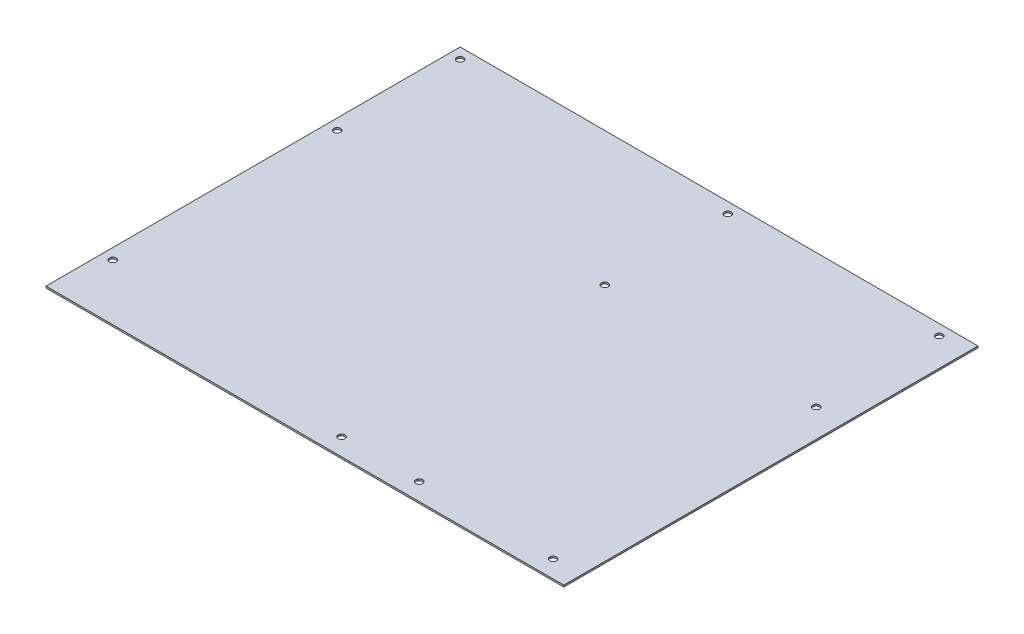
ISO-10303-21;
HEADER;
FILE_DESCRIPTION(('STEP AP214'),'2;1');
FILE_NAME('part.step','',(''),(''),'','','');
FILE_SCHEMA(('AUTOMOTIVE_DESIGN { 1 0 10303 214 1 1 1 1 }'));
ENDSEC;
DATA;
#1=APPLICATION_CONTEXT('core data for automotive mechanical design processes');
#2=APPLICATION_PROTOCOL_DEFINITION('international standard','automotive_design',2000,#1);
#3=PRODUCT_CONTEXT('',#1,'mechanical');
#4=PRODUCT('Part','Part','',(#3));
#5=PRODUCT_RELATED_PRODUCT_CATEGORY('part','',(#4));
#6=PRODUCT_DEFINITION_FORMATION('','',#4);
#7=PRODUCT_DEFINITION_CONTEXT('part definition',#1,'design');
#8=PRODUCT_DEFINITION('design','',#6,#7);
#9=PRODUCT_DEFINITION_SHAPE('','',#8);
#10=(LENGTH_UNIT() NAMED_UNIT(*) SI_UNIT(.MILLI.,.METRE.));
#11=(NAMED_UNIT(*) PLANE_ANGLE_UNIT() SI_UNIT($,.RADIAN.));
#12=(NAMED_UNIT(*) SI_UNIT($,.STERADIAN.) SOLID_ANGLE_UNIT());
#13=UNCERTAINTY_MEASURE_WITH_UNIT(LENGTH_MEASURE(1.E-05),#10,'distance_accuracy_value','');
#14=(GEOMETRIC_REPRESENTATION_CONTEXT(3) GLOBAL_UNCERTAINTY_ASSIGNED_CONTEXT((#13)) GLOBAL_UNIT_ASSIGNED_CONTEXT((#10,
#11,#12)) REPRESENTATION_CONTEXT('',''));
#15=CARTESIAN_POINT('',(0.,0.,0.));
#16=DIRECTION('',(0.,0.,1.));
#17=DIRECTION('',(1.,0.,0.));
#18=AXIS2_PLACEMENT_3D('',#15,#16,#17);
#19=CARTESIAN_POINT('',(0.,1.,0.));
#20=DIRECTION('',(-1.,0.,0.));
#21=DIRECTION('',(0.,0.,1.));
#22=AXIS2_PLACEMENT_3D('',#19,#20,#21);
#23=PLANE('',#22);
#24=DIRECTION('',(0.,0.,-1.));
#25=VECTOR('',#24,1.);
#26=CARTESIAN_POINT('',(0.,0.,0.));
#27=LINE('',#26,#25);
#28=CARTESIAN_POINT('',(0.,0.,0.));
#29=VERTEX_POINT('',#28);
#30=CARTESIAN_POINT('',(0.,0.,-243.8));
#31=VERTEX_POINT('',#30);
#32=EDGE_CURVE('E95',#29,#31,#27,.T.);
#33=ORIENTED_EDGE('',*,*,#32,.T.);
#34=DIRECTION('',(0.,-1.,0.));
#35=VECTOR('',#34,1.);
#36=CARTESIAN_POINT('',(0.,1.,-243.8));
#37=LINE('',#36,#35);
#38=CARTESIAN_POINT('',(0.,1.,-243.8));
#39=VERTEX_POINT('',#38);
#40=EDGE_CURVE('E11',#39,#31,#37,.T.);
#41=ORIENTED_EDGE('',*,*,#40,.F.);
#42=DIRECTION('',(0.,0.,-1.));
#43=VECTOR('',#42,1.);
#44=CARTESIAN_POINT('',(0.,1.,0.));
#45=LINE('',#44,#43);
#46=CARTESIAN_POINT('',(0.,1.,0.));
#47=VERTEX_POINT('',#46);
#48=EDGE_CURVE('E83',#47,#39,#45,.T.);
#49=ORIENTED_EDGE('',*,*,#48,.F.);
#50=DIRECTION('',(0.,-1.,0.));
#51=VECTOR('',#50,1.);
#52=CARTESIAN_POINT('',(0.,1.,0.));
#53=LINE('',#52,#51);
#54=EDGE_CURVE('E91',#47,#29,#53,.T.);
#55=ORIENTED_EDGE('',*,*,#54,.T.);
#56=EDGE_LOOP('',(#33,#41,#49,#55));
#57=FACE_BOUND('',#56,.T.);
#58=ADVANCED_FACE('F32',(#57),#23,.F.);
#59=CARTESIAN_POINT('',(0.,1.,-243.8));
#60=DIRECTION('',(0.,0.,1.));
#61=DIRECTION('',(1.,0.,0.));
#62=AXIS2_PLACEMENT_3D('',#59,#60,#61);
#63=PLANE('',#62);
#64=DIRECTION('',(-1.,0.,0.));
#65=VECTOR('',#64,1.);
#66=CARTESIAN_POINT('',(0.,0.,-243.8));
#67=LINE('',#66,#65);
#68=CARTESIAN_POINT('',(-304.8,0.,-243.8));
#69=VERTEX_POINT('',#68);
#70=EDGE_CURVE('E87',#31,#69,#67,.T.);
#71=ORIENTED_EDGE('',*,*,#70,.T.);
#72=DIRECTION('',(0.,-1.,0.));
#73=VECTOR('',#72,1.);
#74=CARTESIAN_POINT('',(-304.8,1.,-243.8));
#75=LINE('',#74,#73);
#76=CARTESIAN_POINT('',(-304.8,1.,-243.8));
#77=VERTEX_POINT('',#76);
#78=EDGE_CURVE('E40',#77,#69,#75,.T.);
#79=ORIENTED_EDGE('',*,*,#78,.F.);
#80=DIRECTION('',(-1.,0.,0.));
#81=VECTOR('',#80,1.);
#82=CARTESIAN_POINT('',(0.,1.,-243.8));
#83=LINE('',#82,#81);
#84=EDGE_CURVE('E78',#39,#77,#83,.T.);
#85=ORIENTED_EDGE('',*,*,#84,.F.);
#86=ORIENTED_EDGE('',*,*,#40,.T.);
#87=EDGE_LOOP('',(#71,#79,#85,#86));
#88=FACE_BOUND('',#87,.T.);
#89=ADVANCED_FACE('F86',(#88),#63,.F.);
#90=CARTESIAN_POINT('',(-304.8,1.,0.));
#91=DIRECTION('',(1.,0.,0.));
#92=DIRECTION('',(0.,0.,-1.));
#93=AXIS2_PLACEMENT_3D('',#90,#91,#92);
#94=PLANE('',#93);
#95=DIRECTION('',(0.,0.,1.));
#96=VECTOR('',#95,1.);
#97=CARTESIAN_POINT('',(-304.8,0.,0.));
#98=LINE('',#97,#96);
#99=CARTESIAN_POINT('',(-304.8,0.,0.));
#100=VERTEX_POINT('',#99);
#101=EDGE_CURVE('E65',#69,#100,#98,.T.);
#102=ORIENTED_EDGE('',*,*,#101,.T.);
#103=DIRECTION('',(0.,-1.,0.));
#104=VECTOR('',#103,1.);
#105=CARTESIAN_POINT('',(-304.8,1.,0.));
#106=LINE('',#105,#104);
#107=CARTESIAN_POINT('',(-304.8,1.,0.));
#108=VERTEX_POINT('',#107);
#109=EDGE_CURVE('E88',#108,#100,#106,.T.);
#110=ORIENTED_EDGE('',*,*,#109,.F.);
#111=DIRECTION('',(0.,0.,1.));
#112=VECTOR('',#111,1.);
#113=CARTESIAN_POINT('',(-304.8,1.,0.));
#114=LINE('',#113,#112);
#115=EDGE_CURVE('E81',#77,#108,#114,.T.);
#116=ORIENTED_EDGE('',*,*,#115,.F.);
#117=ORIENTED_EDGE('',*,*,#78,.T.);
#118=EDGE_LOOP('',(#102,#110,#116,#117));
#119=FACE_BOUND('',#118,.T.);
#120=ADVANCED_FACE('F89',(#119),#94,.F.);
#121=CARTESIAN_POINT('',(0.,1.,0.));
#122=DIRECTION('',(0.,0.,-1.));
#123=DIRECTION('',(-1.,0.,0.));
#124=AXIS2_PLACEMENT_3D('',#121,#122,#123);
#125=PLANE('',#124);
#126=DIRECTION('',(1.,0.,0.));
#127=VECTOR('',#126,1.);
#128=CARTESIAN_POINT('',(0.,0.,0.));
#129=LINE('',#128,#127);
#130=EDGE_CURVE('E71',#100,#29,#129,.T.);
#131=ORIENTED_EDGE('',*,*,#130,.T.);
#132=ORIENTED_EDGE('',*,*,#54,.F.);
#133=DIRECTION('',(1.,0.,0.));
#134=VECTOR('',#133,1.);
#135=CARTESIAN_POINT('',(0.,1.,0.));
#136=LINE('',#135,#134);
#137=EDGE_CURVE('E48',#108,#47,#136,.T.);
#138=ORIENTED_EDGE('',*,*,#137,.F.);
#139=ORIENTED_EDGE('',*,*,#109,.T.);
#140=EDGE_LOOP('',(#131,#132,#138,#139));
#141=FACE_BOUND('',#140,.T.);
#142=ADVANCED_FACE('F103',(#141),#125,.F.);
#143=CARTESIAN_POINT('',(0.,1.,0.));
#144=DIRECTION('',(0.,1.,0.));
#145=DIRECTION('',(0.,0.,1.));
#146=AXIS2_PLACEMENT_3D('',#143,#144,#145);
#147=PLANE('',#146);
#148=CARTESIAN_POINT('',(-298.5,1.,-32.9999999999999));
#149=DIRECTION('',(0.,1.,0.));
#150=DIRECTION('',(0.,0.,1.));
#151=AXIS2_PLACEMENT_3D('',#148,#149,#150);
#152=CIRCLE('',#151,2.);
#153=CARTESIAN_POINT('',(-298.5,1.,-31.));
#154=VERTEX_POINT('',#153);
#155=EDGE_CURVE('E163',#154,#154,#152,.T.);
#156=ORIENTED_EDGE('',*,*,#155,.F.);
#157=EDGE_LOOP('',(#156));
#158=FACE_BOUND('',#157,.T.);
#159=CARTESIAN_POINT('',(-95.3,1.,-10.2));
#160=DIRECTION('',(0.,1.,0.));
#161=DIRECTION('',(0.,0.,1.));
#162=AXIS2_PLACEMENT_3D('',#159,#160,#161);
#163=CIRCLE('',#162,2.);
#164=CARTESIAN_POINT('',(-95.3,1.,-8.19999999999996));
#165=VERTEX_POINT('',#164);
#166=EDGE_CURVE('E157',#165,#165,#163,.T.);
#167=ORIENTED_EDGE('',*,*,#166,.F.);
#168=EDGE_LOOP('',(#167));
#169=FACE_BOUND('',#168,.T.);
#170=CARTESIAN_POINT('',(-141.,1.,-10.2));
#171=DIRECTION('',(0.,1.,0.));
#172=DIRECTION('',(0.,0.,1.));
#173=AXIS2_PLACEMENT_3D('',#170,#171,#172);
#174=CIRCLE('',#173,2.);
#175=CARTESIAN_POINT('',(-141.,1.,-8.19999999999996));
#176=VERTEX_POINT('',#175);
#177=EDGE_CURVE('E151',#176,#176,#174,.T.);
#178=ORIENTED_EDGE('',*,*,#177,.F.);
#179=EDGE_LOOP('',(#178));
#180=FACE_BOUND('',#179,.T.);
#181=CARTESIAN_POINT('',(-141.,1.,-165.1));
#182=DIRECTION('',(0.,1.,0.));
#183=DIRECTION('',(0.,0.,1.));
#184=AXIS2_PLACEMENT_3D('',#181,#182,#183);
#185=CIRCLE('',#184,2.);
#186=CARTESIAN_POINT('',(-141.,1.,-163.1));
#187=VERTEX_POINT('',#186);
#188=EDGE_CURVE('E145',#187,#187,#185,.T.);
#189=ORIENTED_EDGE('',*,*,#188,.F.);
#190=EDGE_LOOP('',(#189));
#191=FACE_BOUND('',#190,.T.);
#192=CARTESIAN_POINT('',(-141.,1.,-237.5));
#193=DIRECTION('',(0.,1.,0.));
#194=DIRECTION('',(0.,0.,1.));
#195=AXIS2_PLACEMENT_3D('',#192,#193,#194);
#196=CIRCLE('',#195,2.);
#197=CARTESIAN_POINT('',(-141.,1.,-235.5));
#198=VERTEX_POINT('',#197);
#199=EDGE_CURVE('E139',#198,#198,#196,.T.);
#200=ORIENTED_EDGE('',*,*,#199,.F.);
#201=EDGE_LOOP('',(#200));
#202=FACE_BOUND('',#201,.T.);
#203=CARTESIAN_POINT('',(-298.5,1.,-237.5));
#204=DIRECTION('',(0.,1.,0.));
#205=DIRECTION('',(0.,0.,1.));
#206=AXIS2_PLACEMENT_3D('',#203,#204,#205);
#207=CIRCLE('',#206,2.);
#208=CARTESIAN_POINT('',(-298.5,1.,-235.5));
#209=VERTEX_POINT('',#208);
#210=EDGE_CURVE('E133',#209,#209,#207,.T.);
#211=ORIENTED_EDGE('',*,*,#210,.F.);
#212=EDGE_LOOP('',(#211));
#213=FACE_BOUND('',#212,.T.);
#214=CARTESIAN_POINT('',(-298.5,1.,-165.1));
#215=DIRECTION('',(0.,1.,0.));
#216=DIRECTION('',(0.,0.,1.));
#217=AXIS2_PLACEMENT_3D('',#214,#215,#216);
#218=CIRCLE('',#217,2.);
#219=CARTESIAN_POINT('',(-298.5,1.,-163.1));
#220=VERTEX_POINT('',#219);
#221=EDGE_CURVE('E127',#220,#220,#218,.T.);
#222=ORIENTED_EDGE('',*,*,#221,.F.);
#223=EDGE_LOOP('',(#222));
#224=FACE_BOUND('',#223,.T.);
#225=CARTESIAN_POINT('',(-16.5,1.,-10.2));
#226=DIRECTION('',(0.,1.,0.));
#227=DIRECTION('',(0.,0.,1.));
#228=AXIS2_PLACEMENT_3D('',#225,#226,#227);
#229=CIRCLE('',#228,2.);
#230=CARTESIAN_POINT('',(-16.5,1.,-8.19999999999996));
#231=VERTEX_POINT('',#230);
#232=EDGE_CURVE('E121',#231,#231,#229,.T.);
#233=ORIENTED_EDGE('',*,*,#232,.F.);
#234=EDGE_LOOP('',(#233));
#235=FACE_BOUND('',#234,.T.);
#236=CARTESIAN_POINT('',(-16.5,1.,-165.1));
#237=DIRECTION('',(0.,1.,0.));
#238=DIRECTION('',(0.,0.,1.));
#239=AXIS2_PLACEMENT_3D('',#236,#237,#238);
#240=CIRCLE('',#239,2.);
#241=CARTESIAN_POINT('',(-16.5,1.,-163.1));
#242=VERTEX_POINT('',#241);
#243=EDGE_CURVE('E115',#242,#242,#240,.T.);
#244=ORIENTED_EDGE('',*,*,#243,.F.);
#245=EDGE_LOOP('',(#244));
#246=FACE_BOUND('',#245,.T.);
#247=CARTESIAN_POINT('',(-16.5,1.,-237.5));
#248=DIRECTION('',(0.,1.,0.));
#249=DIRECTION('',(0.,0.,1.));
#250=AXIS2_PLACEMENT_3D('',#247,#248,#249);
#251=CIRCLE('',#250,2.);
#252=CARTESIAN_POINT('',(-16.5,1.,-235.5));
#253=VERTEX_POINT('',#252);
#254=EDGE_CURVE('E109',#253,#253,#251,.T.);
#255=ORIENTED_EDGE('',*,*,#254,.F.);
#256=EDGE_LOOP('',(#255));
#257=FACE_BOUND('',#256,.T.);
#258=ORIENTED_EDGE('',*,*,#48,.T.);
#259=ORIENTED_EDGE('',*,*,#84,.T.);
#260=ORIENTED_EDGE('',*,*,#115,.T.);
#261=ORIENTED_EDGE('',*,*,#137,.T.);
#262=EDGE_LOOP('',(#258,#259,#260,#261));
#263=FACE_BOUND('',#262,.T.);
#264=ADVANCED_FACE('F79',(#158,#169,#180,#191,#202,#213,#224,#235,#246,#257,#263),#147,.T.);
#265=CARTESIAN_POINT('',(0.,0.,0.));
#266=DIRECTION('',(0.,1.,0.));
#267=DIRECTION('',(0.,0.,1.));
#268=AXIS2_PLACEMENT_3D('',#265,#266,#267);
#269=PLANE('',#268);
#270=CARTESIAN_POINT('',(-298.5,0.,-32.9999999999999));
#271=DIRECTION('',(0.,1.,0.));
#272=DIRECTION('',(0.,0.,1.));
#273=AXIS2_PLACEMENT_3D('',#270,#271,#272);
#274=CIRCLE('',#273,2.);
#275=CARTESIAN_POINT('',(-298.5,0.,-31.));
#276=VERTEX_POINT('',#275);
#277=EDGE_CURVE('E160',#276,#276,#274,.T.);
#278=ORIENTED_EDGE('',*,*,#277,.T.);
#279=EDGE_LOOP('',(#278));
#280=FACE_BOUND('',#279,.T.);
#281=CARTESIAN_POINT('',(-95.3,0.,-10.2));
#282=DIRECTION('',(0.,1.,0.));
#283=DIRECTION('',(0.,0.,1.));
#284=AXIS2_PLACEMENT_3D('',#281,#282,#283);
#285=CIRCLE('',#284,2.);
#286=CARTESIAN_POINT('',(-95.3,0.,-8.19999999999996));
#287=VERTEX_POINT('',#286);
#288=EDGE_CURVE('E154',#287,#287,#285,.T.);
#289=ORIENTED_EDGE('',*,*,#288,.T.);
#290=EDGE_LOOP('',(#289));
#291=FACE_BOUND('',#290,.T.);
#292=CARTESIAN_POINT('',(-141.,0.,-10.2));
#293=DIRECTION('',(0.,1.,0.));
#294=DIRECTION('',(0.,0.,1.));
#295=AXIS2_PLACEMENT_3D('',#292,#293,#294);
#296=CIRCLE('',#295,2.);
#297=CARTESIAN_POINT('',(-141.,0.,-8.19999999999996));
#298=VERTEX_POINT('',#297);
#299=EDGE_CURVE('E148',#298,#298,#296,.T.);
#300=ORIENTED_EDGE('',*,*,#299,.T.);
#301=EDGE_LOOP('',(#300));
#302=FACE_BOUND('',#301,.T.);
#303=CARTESIAN_POINT('',(-141.,0.,-165.1));
#304=DIRECTION('',(0.,1.,0.));
#305=DIRECTION('',(0.,0.,1.));
#306=AXIS2_PLACEMENT_3D('',#303,#304,#305);
#307=CIRCLE('',#306,2.);
#308=CARTESIAN_POINT('',(-141.,0.,-163.1));
#309=VERTEX_POINT('',#308);
#310=EDGE_CURVE('E142',#309,#309,#307,.T.);
#311=ORIENTED_EDGE('',*,*,#310,.T.);
#312=EDGE_LOOP('',(#311));
#313=FACE_BOUND('',#312,.T.);
#314=CARTESIAN_POINT('',(-141.,0.,-237.5));
#315=DIRECTION('',(0.,1.,0.));
#316=DIRECTION('',(0.,0.,1.));
#317=AXIS2_PLACEMENT_3D('',#314,#315,#316);
#318=CIRCLE('',#317,2.);
#319=CARTESIAN_POINT('',(-141.,0.,-235.5));
#320=VERTEX_POINT('',#319);
#321=EDGE_CURVE('E136',#320,#320,#318,.T.);
#322=ORIENTED_EDGE('',*,*,#321,.T.);
#323=EDGE_LOOP('',(#322));
#324=FACE_BOUND('',#323,.T.);
#325=CARTESIAN_POINT('',(-298.5,0.,-237.5));
#326=DIRECTION('',(0.,1.,0.));
#327=DIRECTION('',(0.,0.,1.));
#328=AXIS2_PLACEMENT_3D('',#325,#326,#327);
#329=CIRCLE('',#328,2.);
#330=CARTESIAN_POINT('',(-298.5,0.,-235.5));
#331=VERTEX_POINT('',#330);
#332=EDGE_CURVE('E130',#331,#331,#329,.T.);
#333=ORIENTED_EDGE('',*,*,#332,.T.);
#334=EDGE_LOOP('',(#333));
#335=FACE_BOUND('',#334,.T.);
#336=CARTESIAN_POINT('',(-298.5,0.,-165.1));
#337=DIRECTION('',(0.,1.,0.));
#338=DIRECTION('',(0.,0.,1.));
#339=AXIS2_PLACEMENT_3D('',#336,#337,#338);
#340=CIRCLE('',#339,2.);
#341=CARTESIAN_POINT('',(-298.5,0.,-163.1));
#342=VERTEX_POINT('',#341);
#343=EDGE_CURVE('E124',#342,#342,#340,.T.);
#344=ORIENTED_EDGE('',*,*,#343,.T.);
#345=EDGE_LOOP('',(#344));
#346=FACE_BOUND('',#345,.T.);
#347=CARTESIAN_POINT('',(-16.5,0.,-10.2));
#348=DIRECTION('',(0.,1.,0.));
#349=DIRECTION('',(0.,0.,1.));
#350=AXIS2_PLACEMENT_3D('',#347,#348,#349);
#351=CIRCLE('',#350,2.);
#352=CARTESIAN_POINT('',(-16.5,0.,-8.19999999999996));
#353=VERTEX_POINT('',#352);
#354=EDGE_CURVE('E118',#353,#353,#351,.T.);
#355=ORIENTED_EDGE('',*,*,#354,.T.);
#356=EDGE_LOOP('',(#355));
#357=FACE_BOUND('',#356,.T.);
#358=CARTESIAN_POINT('',(-16.5,0.,-165.1));
#359=DIRECTION('',(0.,1.,0.));
#360=DIRECTION('',(0.,0.,1.));
#361=AXIS2_PLACEMENT_3D('',#358,#359,#360);
#362=CIRCLE('',#361,2.);
#363=CARTESIAN_POINT('',(-16.5,0.,-163.1));
#364=VERTEX_POINT('',#363);
#365=EDGE_CURVE('E112',#364,#364,#362,.T.);
#366=ORIENTED_EDGE('',*,*,#365,.T.);
#367=EDGE_LOOP('',(#366));
#368=FACE_BOUND('',#367,.T.);
#369=CARTESIAN_POINT('',(-16.5,0.,-237.5));
#370=DIRECTION('',(0.,1.,0.));
#371=DIRECTION('',(0.,0.,1.));
#372=AXIS2_PLACEMENT_3D('',#369,#370,#371);
#373=CIRCLE('',#372,2.);
#374=CARTESIAN_POINT('',(-16.5,0.,-235.5));
#375=VERTEX_POINT('',#374);
#376=EDGE_CURVE('E98',#375,#375,#373,.T.);
#377=ORIENTED_EDGE('',*,*,#376,.T.);
#378=EDGE_LOOP('',(#377));
#379=FACE_BOUND('',#378,.T.);
#380=ORIENTED_EDGE('',*,*,#32,.F.);
#381=ORIENTED_EDGE('',*,*,#130,.F.);
#382=ORIENTED_EDGE('',*,*,#101,.F.);
#383=ORIENTED_EDGE('',*,*,#70,.F.);
#384=EDGE_LOOP('',(#380,#381,#382,#383));
#385=FACE_BOUND('',#384,.T.);
#386=ADVANCED_FACE('F106',(#280,#291,#302,#313,#324,#335,#346,#357,#368,#379,#385),#269,.F.);
#387=CARTESIAN_POINT('',(-16.5,0.,-237.5));
#388=DIRECTION('',(0.,1.,0.));
#389=DIRECTION('',(0.,0.,1.));
#390=AXIS2_PLACEMENT_3D('',#387,#388,#389);
#391=CYLINDRICAL_SURFACE('',#390,2.);
#392=ORIENTED_EDGE('',*,*,#376,.F.);
#393=EDGE_LOOP('',(#392));
#394=FACE_BOUND('',#393,.T.);
#395=ORIENTED_EDGE('',*,*,#254,.T.);
#396=EDGE_LOOP('',(#395));
#397=FACE_BOUND('',#396,.T.);
#398=ADVANCED_FACE('F199',(#394,#397),#391,.F.);
#399=CARTESIAN_POINT('',(-16.5,0.,-165.1));
#400=DIRECTION('',(0.,1.,0.));
#401=DIRECTION('',(0.,0.,1.));
#402=AXIS2_PLACEMENT_3D('',#399,#400,#401);
#403=CYLINDRICAL_SURFACE('',#402,2.);
#404=ORIENTED_EDGE('',*,*,#365,.F.);
#405=EDGE_LOOP('',(#404));
#406=FACE_BOUND('',#405,.T.);
#407=ORIENTED_EDGE('',*,*,#243,.T.);
#408=EDGE_LOOP('',(#407));
#409=FACE_BOUND('',#408,.T.);
#410=ADVANCED_FACE('F201',(#406,#409),#403,.F.);
#411=CARTESIAN_POINT('',(-16.5,0.,-10.2));
#412=DIRECTION('',(0.,1.,0.));
#413=DIRECTION('',(0.,0.,1.));
#414=AXIS2_PLACEMENT_3D('',#411,#412,#413);
#415=CYLINDRICAL_SURFACE('',#414,2.);
#416=ORIENTED_EDGE('',*,*,#354,.F.);
#417=EDGE_LOOP('',(#416));
#418=FACE_BOUND('',#417,.T.);
#419=ORIENTED_EDGE('',*,*,#232,.T.);
#420=EDGE_LOOP('',(#419));
#421=FACE_BOUND('',#420,.T.);
#422=ADVANCED_FACE('F208',(#418,#421),#415,.F.);
#423=CARTESIAN_POINT('',(-298.5,0.,-165.1));
#424=DIRECTION('',(0.,1.,0.));
#425=DIRECTION('',(0.,0.,1.));
#426=AXIS2_PLACEMENT_3D('',#423,#424,#425);
#427=CYLINDRICAL_SURFACE('',#426,2.);
#428=ORIENTED_EDGE('',*,*,#343,.F.);
#429=EDGE_LOOP('',(#428));
#430=FACE_BOUND('',#429,.T.);
#431=ORIENTED_EDGE('',*,*,#221,.T.);
#432=EDGE_LOOP('',(#431));
#433=FACE_BOUND('',#432,.T.);
#434=ADVANCED_FACE('F254',(#430,#433),#427,.F.);
#435=CARTESIAN_POINT('',(-298.5,0.,-237.5));
#436=DIRECTION('',(0.,1.,0.));
#437=DIRECTION('',(0.,0.,1.));
#438=AXIS2_PLACEMENT_3D('',#435,#436,#437);
#439=CYLINDRICAL_SURFACE('',#438,2.);
#440=ORIENTED_EDGE('',*,*,#332,.F.);
#441=EDGE_LOOP('',(#440));
#442=FACE_BOUND('',#441,.T.);
#443=ORIENTED_EDGE('',*,*,#210,.T.);
#444=EDGE_LOOP('',(#443));
#445=FACE_BOUND('',#444,.T.);
#446=ADVANCED_FACE('F264',(#442,#445),#439,.F.);
#447=CARTESIAN_POINT('',(-141.,0.,-237.5));
#448=DIRECTION('',(0.,1.,0.));
#449=DIRECTION('',(0.,0.,1.));
#450=AXIS2_PLACEMENT_3D('',#447,#448,#449);
#451=CYLINDRICAL_SURFACE('',#450,2.);
#452=ORIENTED_EDGE('',*,*,#321,.F.);
#453=EDGE_LOOP('',(#452));
#454=FACE_BOUND('',#453,.T.);
#455=ORIENTED_EDGE('',*,*,#199,.T.);
#456=EDGE_LOOP('',(#455));
#457=FACE_BOUND('',#456,.T.);
#458=ADVANCED_FACE('F274',(#454,#457),#451,.F.);
#459=CARTESIAN_POINT('',(-141.,0.,-165.1));
#460=DIRECTION('',(0.,1.,0.));
#461=DIRECTION('',(0.,0.,1.));
#462=AXIS2_PLACEMENT_3D('',#459,#460,#461);
#463=CYLINDRICAL_SURFACE('',#462,2.);
#464=ORIENTED_EDGE('',*,*,#310,.F.);
#465=EDGE_LOOP('',(#464));
#466=FACE_BOUND('',#465,.T.);
#467=ORIENTED_EDGE('',*,*,#188,.T.);
#468=EDGE_LOOP('',(#467));
#469=FACE_BOUND('',#468,.T.);
#470=ADVANCED_FACE('F284',(#466,#469),#463,.F.);
#471=CARTESIAN_POINT('',(-141.,0.,-10.2));
#472=DIRECTION('',(0.,1.,0.));
#473=DIRECTION('',(0.,0.,1.));
#474=AXIS2_PLACEMENT_3D('',#471,#472,#473);
#475=CYLINDRICAL_SURFACE('',#474,2.);
#476=ORIENTED_EDGE('',*,*,#299,.F.);
#477=EDGE_LOOP('',(#476));
#478=FACE_BOUND('',#477,.T.);
#479=ORIENTED_EDGE('',*,*,#177,.T.);
#480=EDGE_LOOP('',(#479));
#481=FACE_BOUND('',#480,.T.);
#482=ADVANCED_FACE('F294',(#478,#481),#475,.F.);
#483=CARTESIAN_POINT('',(-95.3,0.,-10.2));
#484=DIRECTION('',(0.,1.,0.));
#485=DIRECTION('',(0.,0.,1.));
#486=AXIS2_PLACEMENT_3D('',#483,#484,#485);
#487=CYLINDRICAL_SURFACE('',#486,2.);
#488=ORIENTED_EDGE('',*,*,#288,.F.);
#489=EDGE_LOOP('',(#488));
#490=FACE_BOUND('',#489,.T.);
#491=ORIENTED_EDGE('',*,*,#166,.T.);
#492=EDGE_LOOP('',(#491));
#493=FACE_BOUND('',#492,.T.);
#494=ADVANCED_FACE('F174',(#490,#493),#487,.F.);
#495=CARTESIAN_POINT('',(-298.5,0.,-32.9999999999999));
#496=DIRECTION('',(0.,1.,0.));
#497=DIRECTION('',(0.,0.,1.));
#498=AXIS2_PLACEMENT_3D('',#495,#496,#497);
#499=CYLINDRICAL_SURFACE('',#498,2.);
#500=ORIENTED_EDGE('',*,*,#277,.F.);
#501=EDGE_LOOP('',(#500));
#502=FACE_BOUND('',#501,.T.);
#503=ORIENTED_EDGE('',*,*,#155,.T.);
#504=EDGE_LOOP('',(#503));
#505=FACE_BOUND('',#504,.T.);
#506=ADVANCED_FACE('F171',(#502,#505),#499,.F.);
#507=CLOSED_SHELL('',(#58,#89,#120,#142,#264,#386,#398,#410,#422,#434,#446,#458,#470,#482,#494,#506));
#508=MANIFOLD_SOLID_BREP('B2',#507);
#509=ADVANCED_BREP_SHAPE_REPRESENTATION('',(#18,#508),#14);
#510=SHAPE_DEFINITION_REPRESENTATION(#9,#509);
ENDSEC;
END-ISO-10303-21;
